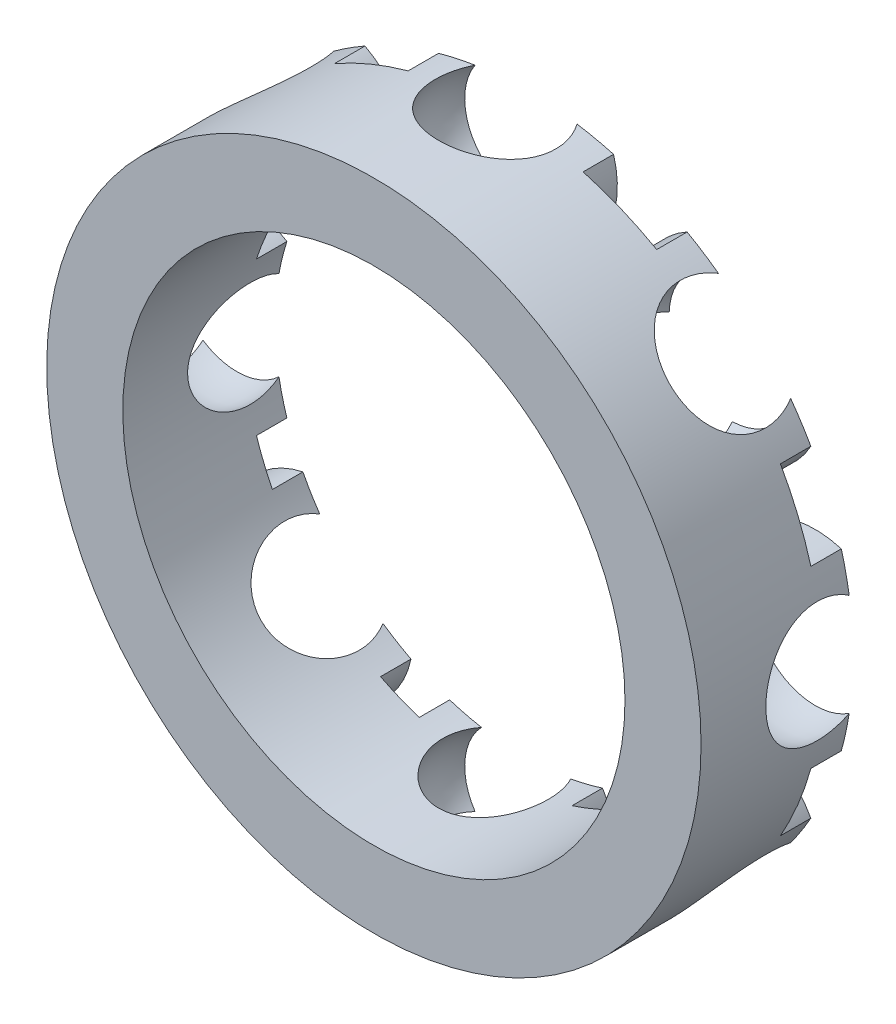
from build123d import *

# Parameters (mm, degrees)
ESQUISSE1_R                  = 10.75
ESQUISSE1_R_2                = 8.25
BASE_EXTRUSION_DEPTH         = 5
ENL_V_MAT_EXTRU_3_DEPTH      = 1
R_P_TITION_CIRCULAIRE2_COUNT = 8


with BuildPart() as part:
    # Esquisse1 → Base-Extrusion (new body)
    with BuildSketch(Plane.XY):
        Circle(ESQUISSE1_R)
        Circle(ESQUISSE1_R_2, mode=Mode.SUBTRACT)
    extrude(amount=BASE_EXTRUSION_DEPTH)

    # Esquisse4 → Enl_vement de mati_re-R_volution1 (revolve, cut)
    with BuildSketch(Plane(origin=(0, 0, 0), x_dir=(1, 0, 0), z_dir=(0, 1, 0))):
        with BuildLine():
            Line((-9.5, 1.25), (-9.5, -3.25))
            ThreePointArc((-9.5, -3.25), (-11.75, -1), (-9.5, 1.25))
        make_face()
    enl_vement_de_mati_re_r_volution1 = revolve(axis=Axis((-9.5, 0, -9), (0, 0, 1)), mode=Mode.SUBTRACT)

    # Esquisse5 → Enl_v. mat.-Extru.3 (cut)
    with BuildSketch(Plane(origin=(0, 0, 0), x_dir=(-1, 0, 0), z_dir=(0, 0, -1))):
        with BuildLine():
            Line((9.606133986, 5.90765208), (10.811943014, 2.697926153))
            ThreePointArc((10.811943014, 2.697926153), (9.079777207, 2.970423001), (7.491171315, 2.228139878))
            Line((7.491171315, 2.228139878), (6.928852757, 3.724967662))
            ThreePointArc((6.928852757, 3.724967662), (8.613157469, 4.392318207), (9.606133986, 5.90765208))
        make_face()
    enl_v_mat_extru_3 = extrude(amount=-ENL_V_MAT_EXTRU_3_DEPTH, mode=Mode.SUBTRACT)

    # R_p_tition circulaire2: Enl_vement de mati_re-R_volution1, Enl_v. mat.-Extru.3 ×8 about axis
    r_p_tition_circulaire2_axis = Axis((0, 0, 0), (0, 0, 1))
    add([enl_vement_de_mati_re_r_volution1.rotate(r_p_tition_circulaire2_axis, i * 360 / R_P_TITION_CIRCULAIRE2_COUNT) for i in range(1, R_P_TITION_CIRCULAIRE2_COUNT)], mode=Mode.SUBTRACT)
    add([enl_v_mat_extru_3.rotate(r_p_tition_circulaire2_axis, i * 360 / R_P_TITION_CIRCULAIRE2_COUNT) for i in range(1, R_P_TITION_CIRCULAIRE2_COUNT)], mode=Mode.SUBTRACT)


solid = part.part
